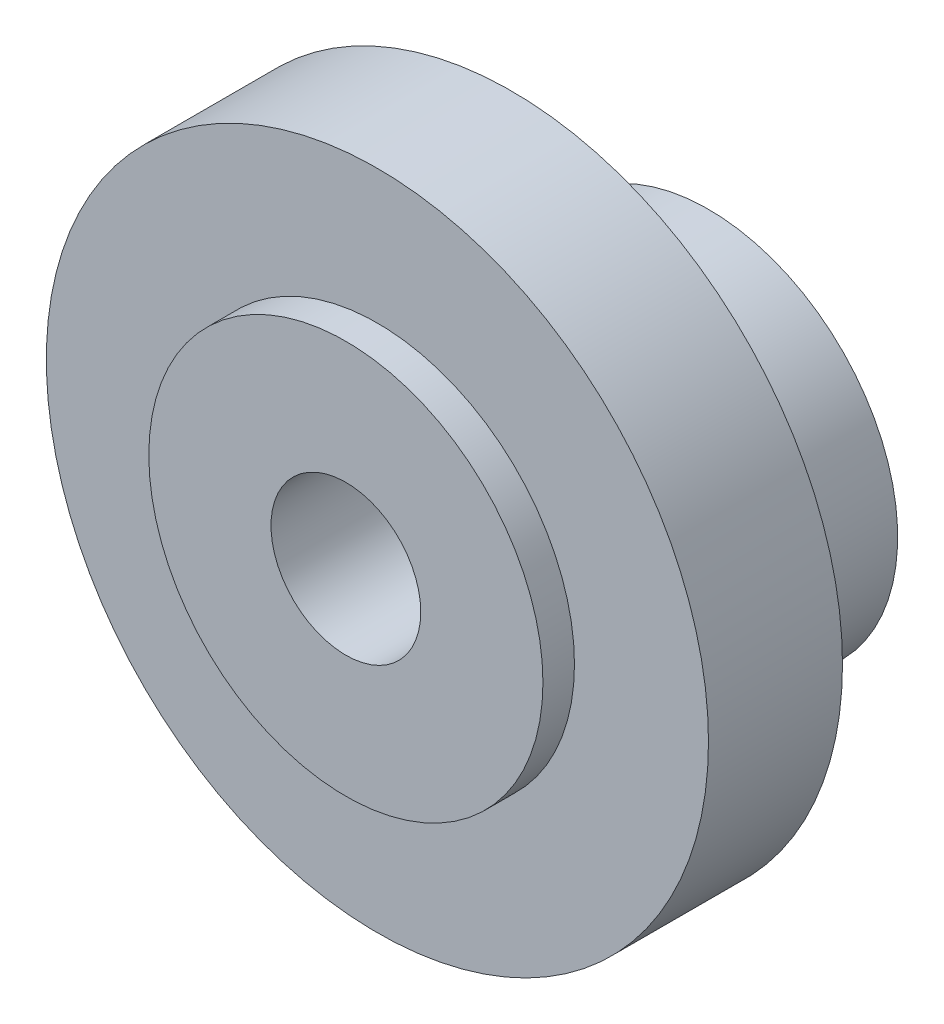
ISO-10303-21;
HEADER;
FILE_DESCRIPTION(('STEP AP214'),'2;1');
FILE_NAME('part.step','',(''),(''),'','','');
FILE_SCHEMA(('AUTOMOTIVE_DESIGN { 1 0 10303 214 1 1 1 1 }'));
ENDSEC;
DATA;
#1=APPLICATION_CONTEXT('core data for automotive mechanical design processes');
#2=APPLICATION_PROTOCOL_DEFINITION('international standard','automotive_design',2000,#1);
#3=PRODUCT_CONTEXT('',#1,'mechanical');
#4=PRODUCT('Part','Part','',(#3));
#5=PRODUCT_RELATED_PRODUCT_CATEGORY('part','',(#4));
#6=PRODUCT_DEFINITION_FORMATION('','',#4);
#7=PRODUCT_DEFINITION_CONTEXT('part definition',#1,'design');
#8=PRODUCT_DEFINITION('design','',#6,#7);
#9=PRODUCT_DEFINITION_SHAPE('','',#8);
#10=(LENGTH_UNIT() NAMED_UNIT(*) SI_UNIT(.MILLI.,.METRE.));
#11=(NAMED_UNIT(*) PLANE_ANGLE_UNIT() SI_UNIT($,.RADIAN.));
#12=(NAMED_UNIT(*) SI_UNIT($,.STERADIAN.) SOLID_ANGLE_UNIT());
#13=UNCERTAINTY_MEASURE_WITH_UNIT(LENGTH_MEASURE(1.E-05),#10,'distance_accuracy_value','');
#14=(GEOMETRIC_REPRESENTATION_CONTEXT(3) GLOBAL_UNCERTAINTY_ASSIGNED_CONTEXT((#13)) GLOBAL_UNIT_ASSIGNED_CONTEXT((#10,
#11,#12)) REPRESENTATION_CONTEXT('',''));
#15=CARTESIAN_POINT('',(0.,0.,0.));
#16=DIRECTION('',(0.,0.,1.));
#17=DIRECTION('',(1.,0.,0.));
#18=AXIS2_PLACEMENT_3D('',#15,#16,#17);
#19=CARTESIAN_POINT('',(0.,7.5,42.));
#20=DIRECTION('',(0.,0.,1.));
#21=DIRECTION('',(1.,0.,0.));
#22=AXIS2_PLACEMENT_3D('',#19,#20,#21);
#23=PLANE('',#22);
#24=CARTESIAN_POINT('',(0.,7.5,42.));
#25=DIRECTION('',(0.,0.,1.));
#26=DIRECTION('',(1.,0.,0.));
#27=AXIS2_PLACEMENT_3D('',#24,#25,#26);
#28=CIRCLE('',#27,42.);
#29=CARTESIAN_POINT('',(42.,7.5,42.));
#30=VERTEX_POINT('',#29);
#31=EDGE_CURVE('E71',#30,#30,#28,.T.);
#32=ORIENTED_EDGE('',*,*,#31,.T.);
#33=EDGE_LOOP('',(#32));
#34=FACE_BOUND('',#33,.T.);
#35=CARTESIAN_POINT('',(0.,7.5,42.));
#36=DIRECTION('',(0.,0.,1.));
#37=DIRECTION('',(1.,0.,0.));
#38=AXIS2_PLACEMENT_3D('',#35,#36,#37);
#39=CIRCLE('',#38,25.);
#40=CARTESIAN_POINT('',(25.,7.5,42.));
#41=VERTEX_POINT('',#40);
#42=EDGE_CURVE('E214',#41,#41,#39,.T.);
#43=ORIENTED_EDGE('',*,*,#42,.F.);
#44=EDGE_LOOP('',(#43));
#45=FACE_BOUND('',#44,.T.);
#46=ADVANCED_FACE('F34',(#34,#45),#23,.T.);
#47=CARTESIAN_POINT('',(0.,7.5,25.));
#48=DIRECTION('',(0.,0.,-1.));
#49=DIRECTION('',(-1.,0.,0.));
#50=AXIS2_PLACEMENT_3D('',#47,#48,#49);
#51=CYLINDRICAL_SURFACE('',#50,25.);
#52=CARTESIAN_POINT('',(0.,7.5,25.));
#53=DIRECTION('',(0.,0.,1.));
#54=DIRECTION('',(1.,0.,0.));
#55=AXIS2_PLACEMENT_3D('',#52,#53,#54);
#56=CIRCLE('',#55,25.);
#57=CARTESIAN_POINT('',(25.,7.5,25.));
#58=VERTEX_POINT('',#57);
#59=EDGE_CURVE('E63',#58,#58,#56,.T.);
#60=ORIENTED_EDGE('',*,*,#59,.F.);
#61=EDGE_LOOP('',(#60));
#62=FACE_BOUND('',#61,.T.);
#63=DIRECTION('',(0.,0.,-1.));
#64=VECTOR('',#63,1.);
#65=CARTESIAN_POINT('',(-24.0432422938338,14.35,14.));
#66=LINE('',#65,#64);
#67=CARTESIAN_POINT('',(-24.0432422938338,14.35,15.));
#68=VERTEX_POINT('',#67);
#69=CARTESIAN_POINT('',(-24.0432422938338,14.35,13.));
#70=VERTEX_POINT('',#69);
#71=EDGE_CURVE('E11',#68,#70,#66,.T.);
#72=ORIENTED_EDGE('',*,*,#71,.F.);
#73=CARTESIAN_POINT('',(0.,7.5,15.));
#74=DIRECTION('',(0.,0.,1.));
#75=DIRECTION('',(1.,0.,0.));
#76=AXIS2_PLACEMENT_3D('',#73,#74,#75);
#77=CIRCLE('',#76,25.);
#78=CARTESIAN_POINT('',(24.0432422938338,14.35,15.));
#79=VERTEX_POINT('',#78);
#80=EDGE_CURVE('E49',#68,#79,#77,.T.);
#81=ORIENTED_EDGE('',*,*,#80,.T.);
#82=DIRECTION('',(0.,0.,-1.));
#83=VECTOR('',#82,1.);
#84=CARTESIAN_POINT('',(24.0432422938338,14.35,14.));
#85=LINE('',#84,#83);
#86=CARTESIAN_POINT('',(24.0432422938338,14.35,13.));
#87=VERTEX_POINT('',#86);
#88=EDGE_CURVE('E42',#87,#79,#85,.F.);
#89=ORIENTED_EDGE('',*,*,#88,.F.);
#90=CARTESIAN_POINT('',(0.,7.5,13.));
#91=DIRECTION('',(0.,0.,1.));
#92=DIRECTION('',(1.,0.,0.));
#93=AXIS2_PLACEMENT_3D('',#90,#91,#92);
#94=CIRCLE('',#93,25.);
#95=EDGE_CURVE('E59',#87,#70,#94,.T.);
#96=ORIENTED_EDGE('',*,*,#95,.T.);
#97=EDGE_LOOP('',(#72,#81,#89,#96));
#98=FACE_BOUND('',#97,.T.);
#99=ADVANCED_FACE('F66',(#62,#98),#51,.T.);
#100=CARTESIAN_POINT('',(0.,0.,13.));
#101=DIRECTION('',(0.,0.,-1.));
#102=DIRECTION('',(-1.,0.,0.));
#103=AXIS2_PLACEMENT_3D('',#100,#101,#102);
#104=CYLINDRICAL_SURFACE('',#103,24.);
#105=CARTESIAN_POINT('',(0.,0.,13.));
#106=DIRECTION('',(0.,0.,1.));
#107=DIRECTION('',(1.,0.,0.));
#108=AXIS2_PLACEMENT_3D('',#105,#106,#107);
#109=CIRCLE('',#108,24.);
#110=CARTESIAN_POINT('',(-24.,0.,13.));
#111=VERTEX_POINT('',#110);
#112=EDGE_CURVE('E82',#111,#111,#109,.T.);
#113=CARTESIAN_POINT('',(0.,0.,0.));
#114=DIRECTION('',(0.,0.,1.));
#115=DIRECTION('',(1.,0.,0.));
#116=AXIS2_PLACEMENT_3D('',#113,#114,#115);
#117=CIRCLE('',#116,24.);
#118=CARTESIAN_POINT('',(-24.,0.,0.));
#119=VERTEX_POINT('',#118);
#120=EDGE_CURVE('E80',#119,#119,#117,.T.);
#121=CARTESIAN_POINT('',(-24.,0.,13.));
#122=CARTESIAN_POINT('',(-24.,0.,12.8645833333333));
#123=CARTESIAN_POINT('',(-24.,0.,12.7291666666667));
#124=CARTESIAN_POINT('',(-24.,0.,12.4583333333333));
#125=CARTESIAN_POINT('',(-24.,0.,12.3229166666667));
#126=CARTESIAN_POINT('',(-24.,0.,12.0520833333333));
#127=CARTESIAN_POINT('',(-24.,0.,11.9166666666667));
#128=CARTESIAN_POINT('',(-24.,0.,11.6458333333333));
#129=CARTESIAN_POINT('',(-24.,0.,11.5104166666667));
#130=CARTESIAN_POINT('',(-24.,0.,11.2395833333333));
#131=CARTESIAN_POINT('',(-24.,0.,11.1041666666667));
#132=CARTESIAN_POINT('',(-24.,0.,10.8333333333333));
#133=CARTESIAN_POINT('',(-24.,0.,10.6979166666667));
#134=CARTESIAN_POINT('',(-24.,0.,10.4270833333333));
#135=CARTESIAN_POINT('',(-24.,0.,10.2916666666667));
#136=CARTESIAN_POINT('',(-24.,0.,10.0208333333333));
#137=CARTESIAN_POINT('',(-24.,0.,9.88541666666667));
#138=CARTESIAN_POINT('',(-24.,0.,9.61458333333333));
#139=CARTESIAN_POINT('',(-24.,0.,9.47916666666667));
#140=CARTESIAN_POINT('',(-24.,0.,9.20833333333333));
#141=CARTESIAN_POINT('',(-24.,0.,9.07291666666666));
#142=CARTESIAN_POINT('',(-24.,0.,8.80208333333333));
#143=CARTESIAN_POINT('',(-24.,0.,8.66666666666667));
#144=CARTESIAN_POINT('',(-24.,0.,8.39583333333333));
#145=CARTESIAN_POINT('',(-24.,0.,8.26041666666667));
#146=CARTESIAN_POINT('',(-24.,0.,7.98958333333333));
#147=CARTESIAN_POINT('',(-24.,0.,7.85416666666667));
#148=CARTESIAN_POINT('',(-24.,0.,7.58333333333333));
#149=CARTESIAN_POINT('',(-24.,0.,7.44791666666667));
#150=CARTESIAN_POINT('',(-24.,0.,7.17708333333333));
#151=CARTESIAN_POINT('',(-24.,0.,7.04166666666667));
#152=CARTESIAN_POINT('',(-24.,0.,6.77083333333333));
#153=CARTESIAN_POINT('',(-24.,0.,6.63541666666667));
#154=CARTESIAN_POINT('',(-24.,0.,6.36458333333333));
#155=CARTESIAN_POINT('',(-24.,0.,6.22916666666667));
#156=CARTESIAN_POINT('',(-24.,0.,5.95833333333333));
#157=CARTESIAN_POINT('',(-24.,0.,5.82291666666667));
#158=CARTESIAN_POINT('',(-24.,0.,5.55208333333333));
#159=CARTESIAN_POINT('',(-24.,0.,5.41666666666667));
#160=CARTESIAN_POINT('',(-24.,0.,5.14583333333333));
#161=CARTESIAN_POINT('',(-24.,0.,5.01041666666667));
#162=CARTESIAN_POINT('',(-24.,0.,4.73958333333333));
#163=CARTESIAN_POINT('',(-24.,0.,4.60416666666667));
#164=CARTESIAN_POINT('',(-24.,0.,4.33333333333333));
#165=CARTESIAN_POINT('',(-24.,0.,4.19791666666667));
#166=CARTESIAN_POINT('',(-24.,0.,3.92708333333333));
#167=CARTESIAN_POINT('',(-24.,0.,3.79166666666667));
#168=CARTESIAN_POINT('',(-24.,0.,3.52083333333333));
#169=CARTESIAN_POINT('',(-24.,0.,3.38541666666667));
#170=CARTESIAN_POINT('',(-24.,0.,3.11458333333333));
#171=CARTESIAN_POINT('',(-24.,0.,2.97916666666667));
#172=CARTESIAN_POINT('',(-24.,0.,2.70833333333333));
#173=CARTESIAN_POINT('',(-24.,0.,2.57291666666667));
#174=CARTESIAN_POINT('',(-24.,0.,2.30208333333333));
#175=CARTESIAN_POINT('',(-24.,0.,2.16666666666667));
#176=CARTESIAN_POINT('',(-24.,0.,1.89583333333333));
#177=CARTESIAN_POINT('',(-24.,0.,1.76041666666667));
#178=CARTESIAN_POINT('',(-24.,0.,1.48958333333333));
#179=CARTESIAN_POINT('',(-24.,0.,1.35416666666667));
#180=CARTESIAN_POINT('',(-24.,0.,1.08333333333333));
#181=CARTESIAN_POINT('',(-24.,0.,0.947916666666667));
#182=CARTESIAN_POINT('',(-24.,0.,0.677083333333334));
#183=CARTESIAN_POINT('',(-24.,0.,0.541666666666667));
#184=CARTESIAN_POINT('',(-24.,0.,0.270833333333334));
#185=CARTESIAN_POINT('',(-24.,0.,0.135416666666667));
#186=CARTESIAN_POINT('',(-24.,0.,0.));
#187=B_SPLINE_CURVE_WITH_KNOTS('',3,(#121,#122,#123,#124,#125,#126,#127,#128,#129,#130,#131,
#132,#133,#134,#135,#136,#137,#138,#139,#140,#141,#142,#143,#144,#145,#146,#147,#148,#149,#150,
#151,#152,#153,#154,#155,#156,#157,#158,#159,#160,#161,#162,#163,#164,#165,#166,#167,#168,#169,
#170,#171,#172,#173,#174,#175,#176,#177,#178,#179,#180,#181,#182,#183,#184,#185,#186),
.UNSPECIFIED.,.F.,.F.,(4,2,2,2,2,2,2,2,2,2,2,2,2,2,2,2,2,2,2,2,2,2,2,2,2,2,2,2,2,2,2,2,4),(0.,
0.40625,0.812500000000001,1.21875,1.625,2.03125,2.4375,2.84375,3.25,3.65625,4.0625,4.46875,
4.875,5.28125,5.6875,6.09375,6.5,6.90625,7.3125,7.71875,8.125,8.53125,8.9375,9.34375,9.75,
10.15625,10.5625,10.96875,11.375,11.78125,12.1875,12.59375,13.),.UNSPECIFIED.);
#188=EDGE_CURVE('BSEAM36',#111,#119,#187,.T.);
#189=ORIENTED_EDGE('',*,*,#112,.F.);
#190=ORIENTED_EDGE('',*,*,#120,.T.);
#191=ORIENTED_EDGE('',*,*,#188,.T.);
#192=ORIENTED_EDGE('',*,*,#188,.F.);
#193=EDGE_LOOP('',(#189,#191,#190,#192));
#194=FACE_BOUND('',#193,.T.);
#195=ADVANCED_FACE('F36',(#194),#104,.T.);
#196=CARTESIAN_POINT('',(0.,0.,0.));
#197=DIRECTION('',(0.,0.,1.));
#198=DIRECTION('',(1.,0.,0.));
#199=AXIS2_PLACEMENT_3D('',#196,#197,#198);
#200=PLANE('',#199);
#201=CARTESIAN_POINT('',(0.,7.5,0.));
#202=DIRECTION('',(0.,0.,1.));
#203=DIRECTION('',(1.,0.,0.));
#204=AXIS2_PLACEMENT_3D('',#201,#202,#203);
#205=CIRCLE('',#204,9.5);
#206=CARTESIAN_POINT('',(9.5,7.5,0.));
#207=VERTEX_POINT('',#206);
#208=EDGE_CURVE('E209',#207,#207,#205,.T.);
#209=ORIENTED_EDGE('',*,*,#208,.T.);
#210=EDGE_LOOP('',(#209));
#211=FACE_BOUND('',#210,.T.);
#212=ORIENTED_EDGE('',*,*,#120,.F.);
#213=EDGE_LOOP('',(#212));
#214=FACE_BOUND('',#213,.T.);
#215=ADVANCED_FACE('F90',(#211,#214),#200,.F.);
#216=CARTESIAN_POINT('',(0.,7.5,13.));
#217=DIRECTION('',(0.,0.,1.));
#218=DIRECTION('',(1.,0.,0.));
#219=AXIS2_PLACEMENT_3D('',#216,#217,#218);
#220=PLANE('',#219);
#221=ORIENTED_EDGE('',*,*,#112,.T.);
#222=EDGE_LOOP('',(#221));
#223=FACE_BOUND('',#222,.T.);
#224=CARTESIAN_POINT('',(0.,0.,13.));
#225=DIRECTION('',(0.,0.,1.));
#226=DIRECTION('',(1.,0.,0.));
#227=AXIS2_PLACEMENT_3D('',#224,#225,#226);
#228=CIRCLE('',#227,28.);
#229=EDGE_CURVE('E62',#70,#87,#228,.T.);
#230=ORIENTED_EDGE('',*,*,#229,.F.);
#231=ORIENTED_EDGE('',*,*,#95,.F.);
#232=EDGE_LOOP('',(#230,#231));
#233=FACE_BOUND('',#232,.T.);
#234=ADVANCED_FACE('F60',(#223,#233),#220,.F.);
#235=CARTESIAN_POINT('',(0.,0.,15.));
#236=DIRECTION('',(0.,0.,-1.));
#237=DIRECTION('',(-1.,0.,0.));
#238=AXIS2_PLACEMENT_3D('',#235,#236,#237);
#239=CYLINDRICAL_SURFACE('',#238,28.);
#240=CARTESIAN_POINT('',(0.,0.,15.));
#241=DIRECTION('',(0.,0.,1.));
#242=DIRECTION('',(1.,0.,0.));
#243=AXIS2_PLACEMENT_3D('',#240,#241,#242);
#244=CIRCLE('',#243,28.);
#245=EDGE_CURVE('E64',#68,#79,#244,.T.);
#246=ORIENTED_EDGE('',*,*,#245,.F.);
#247=ORIENTED_EDGE('',*,*,#71,.T.);
#248=ORIENTED_EDGE('',*,*,#229,.T.);
#249=ORIENTED_EDGE('',*,*,#88,.T.);
#250=EDGE_LOOP('',(#246,#247,#248,#249));
#251=FACE_BOUND('',#250,.T.);
#252=ADVANCED_FACE('F70',(#251),#239,.T.);
#253=CARTESIAN_POINT('',(0.,0.,15.));
#254=DIRECTION('',(0.,0.,1.));
#255=DIRECTION('',(1.,0.,0.));
#256=AXIS2_PLACEMENT_3D('',#253,#254,#255);
#257=PLANE('',#256);
#258=ORIENTED_EDGE('',*,*,#80,.F.);
#259=ORIENTED_EDGE('',*,*,#245,.T.);
#260=EDGE_LOOP('',(#258,#259));
#261=FACE_BOUND('',#260,.T.);
#262=ADVANCED_FACE('F118',(#261),#257,.T.);
#263=CARTESIAN_POINT('',(0.,7.5,25.));
#264=DIRECTION('',(0.,0.,1.));
#265=DIRECTION('',(1.,0.,0.));
#266=AXIS2_PLACEMENT_3D('',#263,#264,#265);
#267=PLANE('',#266);
#268=CARTESIAN_POINT('',(0.,7.5,25.));
#269=DIRECTION('',(0.,0.,1.));
#270=DIRECTION('',(1.,0.,0.));
#271=AXIS2_PLACEMENT_3D('',#268,#269,#270);
#272=CIRCLE('',#271,42.);
#273=CARTESIAN_POINT('',(42.,7.5,25.));
#274=VERTEX_POINT('',#273);
#275=EDGE_CURVE('E75',#274,#274,#272,.T.);
#276=ORIENTED_EDGE('',*,*,#275,.F.);
#277=EDGE_LOOP('',(#276));
#278=FACE_BOUND('',#277,.T.);
#279=ORIENTED_EDGE('',*,*,#59,.T.);
#280=EDGE_LOOP('',(#279));
#281=FACE_BOUND('',#280,.T.);
#282=ADVANCED_FACE('F114',(#278,#281),#267,.F.);
#283=CARTESIAN_POINT('',(0.,7.5,42.));
#284=DIRECTION('',(0.,0.,-1.));
#285=DIRECTION('',(-1.,0.,0.));
#286=AXIS2_PLACEMENT_3D('',#283,#284,#285);
#287=CYLINDRICAL_SURFACE('',#286,42.);
#288=ORIENTED_EDGE('',*,*,#31,.F.);
#289=EDGE_LOOP('',(#288));
#290=FACE_BOUND('',#289,.T.);
#291=ORIENTED_EDGE('',*,*,#275,.T.);
#292=EDGE_LOOP('',(#291));
#293=FACE_BOUND('',#292,.T.);
#294=ADVANCED_FACE('F117',(#290,#293),#287,.T.);
#295=CARTESIAN_POINT('',(0.,7.5,46.));
#296=DIRECTION('',(0.,0.,-1.));
#297=DIRECTION('',(-1.,0.,0.));
#298=AXIS2_PLACEMENT_3D('',#295,#296,#297);
#299=CYLINDRICAL_SURFACE('',#298,25.);
#300=CARTESIAN_POINT('',(0.,7.5,46.));
#301=DIRECTION('',(0.,0.,1.));
#302=DIRECTION('',(1.,0.,0.));
#303=AXIS2_PLACEMENT_3D('',#300,#301,#302);
#304=CIRCLE('',#303,25.);
#305=CARTESIAN_POINT('',(25.,7.5,46.));
#306=VERTEX_POINT('',#305);
#307=EDGE_CURVE('E217',#306,#306,#304,.T.);
#308=ORIENTED_EDGE('',*,*,#307,.F.);
#309=EDGE_LOOP('',(#308));
#310=FACE_BOUND('',#309,.T.);
#311=ORIENTED_EDGE('',*,*,#42,.T.);
#312=EDGE_LOOP('',(#311));
#313=FACE_BOUND('',#312,.T.);
#314=ADVANCED_FACE('F112',(#310,#313),#299,.T.);
#315=CARTESIAN_POINT('',(0.,7.5,46.));
#316=DIRECTION('',(0.,0.,1.));
#317=DIRECTION('',(1.,0.,0.));
#318=AXIS2_PLACEMENT_3D('',#315,#316,#317);
#319=PLANE('',#318);
#320=CARTESIAN_POINT('',(0.,7.5,46.));
#321=DIRECTION('',(0.,0.,1.));
#322=DIRECTION('',(1.,0.,0.));
#323=AXIS2_PLACEMENT_3D('',#320,#321,#322);
#324=CIRCLE('',#323,9.5);
#325=CARTESIAN_POINT('',(9.5,7.5,46.));
#326=VERTEX_POINT('',#325);
#327=EDGE_CURVE('E212',#326,#326,#324,.T.);
#328=ORIENTED_EDGE('',*,*,#327,.F.);
#329=EDGE_LOOP('',(#328));
#330=FACE_BOUND('',#329,.T.);
#331=ORIENTED_EDGE('',*,*,#307,.T.);
#332=EDGE_LOOP('',(#331));
#333=FACE_BOUND('',#332,.T.);
#334=ADVANCED_FACE('F149',(#330,#333),#319,.T.);
#335=CARTESIAN_POINT('',(0.,7.5,0.));
#336=DIRECTION('',(0.,0.,1.));
#337=DIRECTION('',(1.,0.,0.));
#338=AXIS2_PLACEMENT_3D('',#335,#336,#337);
#339=CYLINDRICAL_SURFACE('',#338,9.5);
#340=ORIENTED_EDGE('',*,*,#208,.F.);
#341=EDGE_LOOP('',(#340));
#342=FACE_BOUND('',#341,.T.);
#343=ORIENTED_EDGE('',*,*,#327,.T.);
#344=EDGE_LOOP('',(#343));
#345=FACE_BOUND('',#344,.T.);
#346=ADVANCED_FACE('F156',(#342,#345),#339,.F.);
#347=CLOSED_SHELL('',(#46,#99,#195,#215,#234,#252,#262,#282,#294,#314,#334,#346));
#348=MANIFOLD_SOLID_BREP('B2',#347);
#349=ADVANCED_BREP_SHAPE_REPRESENTATION('',(#18,#348),#14);
#350=SHAPE_DEFINITION_REPRESENTATION(#9,#349);
ENDSEC;
END-ISO-10303-21;
